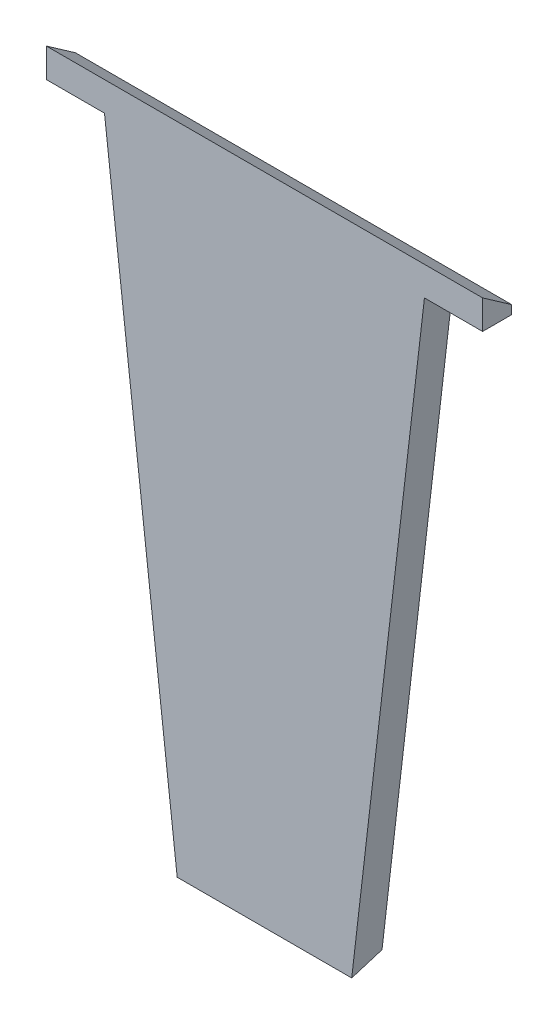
from build123d import *

# Parameters (mm, degrees)
BOSS_EXTRU_1_DEPTH                  = 10
ENL_V_MAT_EXTRU_1_REACH             = 542.925
ENL_V_MAT_EXTRU_2_REACH             = 498.689
ENL_V_MAT_EXTRU_2_DIRECTION_2_REACH = 498.689


with BuildPart() as part:
    # Esquisse1 → Boss.-Extru.1 (new, symmetric)
    with BuildSketch(Plane.XY):
        Polygon((0, 0), (120, 0), (170, 430), (210, 430), (210, 450), (-90, 450), (-90, 430), (-50, 430), align=None)
    extrude(amount=BOSS_EXTRU_1_DEPTH, both=True)

    # Esquisse2 → Enl_v. mat.-Extru.1 (cut, up to next)
    with BuildSketch(Plane(origin=(210, 0, 0), x_dir=(0, 0, -1), z_dir=(1, 0, 0)), mode=Mode.PRIVATE) as enl_v_mat_extru_1_sk1:
        Polygon((-10, 450), (10, 435.995849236), (10, 450), align=None)
    enl_v_mat_extru_1_tool1 = extrude(enl_v_mat_extru_1_sk1.sketch, amount=-ENL_V_MAT_EXTRU_1_REACH, mode=Mode.PRIVATE) & part.part
    add(enl_v_mat_extru_1_tool1.solids().sort_by_distance((210, 445.33195, -3.333333))[0], mode=Mode.SUBTRACT)

    # Esquisse3 → Enl_v. mat.-Extru.2 (cut, up to next)
    with BuildSketch(Plane(origin=(0, 0, 0), x_dir=(0, 0, -1), z_dir=(1, 0, 0)), mode=Mode.PRIVATE) as enl_v_mat_extru_2_sk1:
        Polygon((-10, 0), (10, 7.279404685), (10, 0), align=None)
    enl_v_mat_extru_2_tool1 = extrude(enl_v_mat_extru_2_sk1.sketch, amount=-ENL_V_MAT_EXTRU_2_REACH, mode=Mode.PRIVATE) & part.part
    add(enl_v_mat_extru_2_tool1.solids().sort_by_distance((0, 2.426468, -3.333333))[0], mode=Mode.SUBTRACT)

    # Esquisse3 → Enl_v. mat.-Extru.2 direction 2 (cut, up to next)
    with BuildSketch(Plane(origin=(0, 0, 0), x_dir=(0, 0, -1), z_dir=(1, 0, 0)), mode=Mode.PRIVATE) as enl_v_mat_extru_2_direction_2_sk1:
        Polygon((-10, 0), (10, 7.279404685), (10, 0), align=None)
    enl_v_mat_extru_2_direction_2_tool1 = extrude(enl_v_mat_extru_2_direction_2_sk1.sketch, amount=ENL_V_MAT_EXTRU_2_DIRECTION_2_REACH, mode=Mode.PRIVATE) & part.part
    add(enl_v_mat_extru_2_direction_2_tool1.solids().sort_by_distance((0, 2.426468, -3.333333))[0], mode=Mode.SUBTRACT)


solid = part.part
